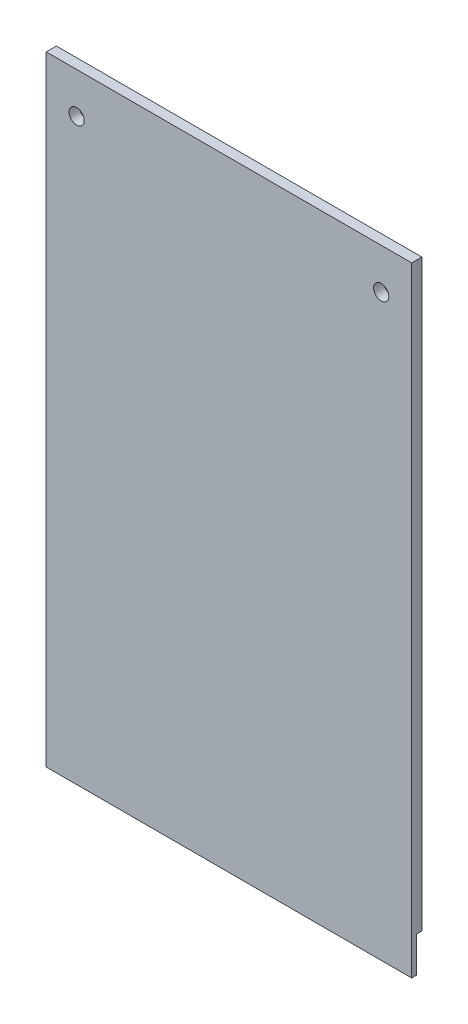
ISO-10303-21;
HEADER;
FILE_DESCRIPTION(('STEP AP214'),'2;1');
FILE_NAME('part.step','',(''),(''),'','','');
FILE_SCHEMA(('AUTOMOTIVE_DESIGN { 1 0 10303 214 1 1 1 1 }'));
ENDSEC;
DATA;
#1=APPLICATION_CONTEXT('core data for automotive mechanical design processes');
#2=APPLICATION_PROTOCOL_DEFINITION('international standard','automotive_design',2000,#1);
#3=PRODUCT_CONTEXT('',#1,'mechanical');
#4=PRODUCT('Part','Part','',(#3));
#5=PRODUCT_RELATED_PRODUCT_CATEGORY('part','',(#4));
#6=PRODUCT_DEFINITION_FORMATION('','',#4);
#7=PRODUCT_DEFINITION_CONTEXT('part definition',#1,'design');
#8=PRODUCT_DEFINITION('design','',#6,#7);
#9=PRODUCT_DEFINITION_SHAPE('','',#8);
#10=(LENGTH_UNIT() NAMED_UNIT(*) SI_UNIT(.MILLI.,.METRE.));
#11=(NAMED_UNIT(*) PLANE_ANGLE_UNIT() SI_UNIT($,.RADIAN.));
#12=(NAMED_UNIT(*) SI_UNIT($,.STERADIAN.) SOLID_ANGLE_UNIT());
#13=UNCERTAINTY_MEASURE_WITH_UNIT(LENGTH_MEASURE(1.E-05),#10,'distance_accuracy_value','');
#14=(GEOMETRIC_REPRESENTATION_CONTEXT(3) GLOBAL_UNCERTAINTY_ASSIGNED_CONTEXT((#13)) GLOBAL_UNIT_ASSIGNED_CONTEXT((#10,
#11,#12)) REPRESENTATION_CONTEXT('',''));
#15=CARTESIAN_POINT('',(0.,0.,0.));
#16=DIRECTION('',(0.,0.,1.));
#17=DIRECTION('',(1.,0.,0.));
#18=AXIS2_PLACEMENT_3D('',#15,#16,#17);
#19=CARTESIAN_POINT('',(36.,122.,2.));
#20=DIRECTION('',(-1.,0.,0.));
#21=DIRECTION('',(0.,-1.,0.));
#22=AXIS2_PLACEMENT_3D('',#19,#20,#21);
#23=PLANE('',#22);
#24=DIRECTION('',(0.,0.,1.));
#25=VECTOR('',#24,1.);
#26=CARTESIAN_POINT('',(36.,0.,0.));
#27=LINE('',#26,#25);
#28=CARTESIAN_POINT('',(36.,0.,1.));
#29=VERTEX_POINT('',#28);
#30=CARTESIAN_POINT('',(36.,0.,2.));
#31=VERTEX_POINT('',#30);
#32=EDGE_CURVE('E116',#29,#31,#27,.T.);
#33=ORIENTED_EDGE('',*,*,#32,.F.);
#34=DIRECTION('',(0.,-1.,0.));
#35=VECTOR('',#34,1.);
#36=CARTESIAN_POINT('',(36.,0.,1.));
#37=LINE('',#36,#35);
#38=CARTESIAN_POINT('',(36.,7.,1.));
#39=VERTEX_POINT('',#38);
#40=EDGE_CURVE('E53',#39,#29,#37,.T.);
#41=ORIENTED_EDGE('',*,*,#40,.F.);
#42=DIRECTION('',(0.,0.,1.));
#43=VECTOR('',#42,1.);
#44=CARTESIAN_POINT('',(36.,7.,1.));
#45=LINE('',#44,#43);
#46=CARTESIAN_POINT('',(36.,7.,0.));
#47=VERTEX_POINT('',#46);
#48=EDGE_CURVE('E131',#47,#39,#45,.T.);
#49=ORIENTED_EDGE('',*,*,#48,.F.);
#50=DIRECTION('',(0.,1.,0.));
#51=VECTOR('',#50,1.);
#52=CARTESIAN_POINT('',(36.,122.,0.));
#53=LINE('',#52,#51);
#54=CARTESIAN_POINT('',(36.,122.,0.));
#55=VERTEX_POINT('',#54);
#56=EDGE_CURVE('E83',#47,#55,#53,.T.);
#57=ORIENTED_EDGE('',*,*,#56,.T.);
#58=DIRECTION('',(0.,0.,-1.));
#59=VECTOR('',#58,1.);
#60=CARTESIAN_POINT('',(36.,122.,2.));
#61=LINE('',#60,#59);
#62=CARTESIAN_POINT('',(36.,122.,2.));
#63=VERTEX_POINT('',#62);
#64=EDGE_CURVE('E11',#63,#55,#61,.T.);
#65=ORIENTED_EDGE('',*,*,#64,.F.);
#66=DIRECTION('',(0.,1.,0.));
#67=VECTOR('',#66,1.);
#68=CARTESIAN_POINT('',(36.,122.,2.));
#69=LINE('',#68,#67);
#70=EDGE_CURVE('E96',#31,#63,#69,.T.);
#71=ORIENTED_EDGE('',*,*,#70,.F.);
#72=EDGE_LOOP('',(#33,#41,#49,#57,#65,#71));
#73=FACE_BOUND('',#72,.T.);
#74=ADVANCED_FACE('F39',(#73),#23,.F.);
#75=CARTESIAN_POINT('',(-36.,122.,2.));
#76=DIRECTION('',(0.,-1.,0.));
#77=DIRECTION('',(0.,0.,-1.));
#78=AXIS2_PLACEMENT_3D('',#75,#76,#77);
#79=PLANE('',#78);
#80=DIRECTION('',(-1.,0.,0.));
#81=VECTOR('',#80,1.);
#82=CARTESIAN_POINT('',(-36.,122.,0.));
#83=LINE('',#82,#81);
#84=CARTESIAN_POINT('',(-36.,122.,0.));
#85=VERTEX_POINT('',#84);
#86=EDGE_CURVE('E74',#55,#85,#83,.T.);
#87=ORIENTED_EDGE('',*,*,#86,.T.);
#88=DIRECTION('',(0.,0.,-1.));
#89=VECTOR('',#88,1.);
#90=CARTESIAN_POINT('',(-36.,122.,2.));
#91=LINE('',#90,#89);
#92=CARTESIAN_POINT('',(-36.,122.,2.));
#93=VERTEX_POINT('',#92);
#94=EDGE_CURVE('E46',#93,#85,#91,.T.);
#95=ORIENTED_EDGE('',*,*,#94,.F.);
#96=DIRECTION('',(-1.,0.,0.));
#97=VECTOR('',#96,1.);
#98=CARTESIAN_POINT('',(-36.,122.,2.));
#99=LINE('',#98,#97);
#100=EDGE_CURVE('E62',#63,#93,#99,.T.);
#101=ORIENTED_EDGE('',*,*,#100,.F.);
#102=ORIENTED_EDGE('',*,*,#64,.T.);
#103=EDGE_LOOP('',(#87,#95,#101,#102));
#104=FACE_BOUND('',#103,.T.);
#105=ADVANCED_FACE('F76',(#104),#79,.F.);
#106=CARTESIAN_POINT('',(-36.,122.,2.));
#107=DIRECTION('',(1.,0.,0.));
#108=DIRECTION('',(0.,1.,0.));
#109=AXIS2_PLACEMENT_3D('',#106,#107,#108);
#110=PLANE('',#109);
#111=DIRECTION('',(0.,0.,1.));
#112=VECTOR('',#111,1.);
#113=CARTESIAN_POINT('',(-36.,7.,1.));
#114=LINE('',#113,#112);
#115=CARTESIAN_POINT('',(-36.,7.,0.));
#116=VERTEX_POINT('',#115);
#117=CARTESIAN_POINT('',(-36.,7.,1.));
#118=VERTEX_POINT('',#117);
#119=EDGE_CURVE('E130',#116,#118,#114,.T.);
#120=ORIENTED_EDGE('',*,*,#119,.T.);
#121=DIRECTION('',(0.,-1.,0.));
#122=VECTOR('',#121,1.);
#123=CARTESIAN_POINT('',(-36.,0.,1.));
#124=LINE('',#123,#122);
#125=CARTESIAN_POINT('',(-36.,0.,1.));
#126=VERTEX_POINT('',#125);
#127=EDGE_CURVE('E126',#118,#126,#124,.T.);
#128=ORIENTED_EDGE('',*,*,#127,.T.);
#129=DIRECTION('',(0.,0.,1.));
#130=VECTOR('',#129,1.);
#131=CARTESIAN_POINT('',(-36.,0.,0.));
#132=LINE('',#131,#130);
#133=CARTESIAN_POINT('',(-36.,0.,2.));
#134=VERTEX_POINT('',#133);
#135=EDGE_CURVE('E113',#126,#134,#132,.T.);
#136=ORIENTED_EDGE('',*,*,#135,.T.);
#137=DIRECTION('',(0.,-1.,0.));
#138=VECTOR('',#137,1.);
#139=CARTESIAN_POINT('',(-36.,122.,2.));
#140=LINE('',#139,#138);
#141=EDGE_CURVE('E91',#93,#134,#140,.T.);
#142=ORIENTED_EDGE('',*,*,#141,.F.);
#143=ORIENTED_EDGE('',*,*,#94,.T.);
#144=DIRECTION('',(0.,-1.,0.));
#145=VECTOR('',#144,1.);
#146=CARTESIAN_POINT('',(-36.,122.,0.));
#147=LINE('',#146,#145);
#148=EDGE_CURVE('E82',#85,#116,#147,.T.);
#149=ORIENTED_EDGE('',*,*,#148,.T.);
#150=EDGE_LOOP('',(#120,#128,#136,#142,#143,#149));
#151=FACE_BOUND('',#150,.T.);
#152=ADVANCED_FACE('F88',(#151),#110,.F.);
#153=CARTESIAN_POINT('',(0.,0.,2.));
#154=DIRECTION('',(0.,0.,1.));
#155=DIRECTION('',(1.,0.,0.));
#156=AXIS2_PLACEMENT_3D('',#153,#154,#155);
#157=PLANE('',#156);
#158=DIRECTION('',(-1.,0.,0.));
#159=VECTOR('',#158,1.);
#160=CARTESIAN_POINT('',(-36.,0.,2.));
#161=LINE('',#160,#159);
#162=EDGE_CURVE('E119',#31,#134,#161,.T.);
#163=ORIENTED_EDGE('',*,*,#162,.F.);
#164=ORIENTED_EDGE('',*,*,#70,.T.);
#165=ORIENTED_EDGE('',*,*,#100,.T.);
#166=ORIENTED_EDGE('',*,*,#141,.T.);
#167=EDGE_LOOP('',(#163,#164,#165,#166));
#168=FACE_BOUND('',#167,.T.);
#169=CARTESIAN_POINT('',(-30.,114.,2.));
#170=DIRECTION('',(0.,0.,1.));
#171=DIRECTION('',(1.,0.,0.));
#172=AXIS2_PLACEMENT_3D('',#169,#170,#171);
#173=CIRCLE('',#172,1.5);
#174=CARTESIAN_POINT('',(-28.5,114.,2.));
#175=VERTEX_POINT('',#174);
#176=EDGE_CURVE('E107',#175,#175,#173,.T.);
#177=ORIENTED_EDGE('',*,*,#176,.F.);
#178=EDGE_LOOP('',(#177));
#179=FACE_BOUND('',#178,.T.);
#180=CARTESIAN_POINT('',(30.,114.,2.));
#181=DIRECTION('',(0.,0.,1.));
#182=DIRECTION('',(1.,0.,0.));
#183=AXIS2_PLACEMENT_3D('',#180,#181,#182);
#184=CIRCLE('',#183,1.5);
#185=CARTESIAN_POINT('',(31.5,114.,2.));
#186=VERTEX_POINT('',#185);
#187=EDGE_CURVE('E104',#186,#186,#184,.T.);
#188=ORIENTED_EDGE('',*,*,#187,.F.);
#189=EDGE_LOOP('',(#188));
#190=FACE_BOUND('',#189,.T.);
#191=ADVANCED_FACE('F159',(#168,#179,#190),#157,.T.);
#192=CARTESIAN_POINT('',(0.,0.,0.));
#193=DIRECTION('',(0.,0.,1.));
#194=DIRECTION('',(1.,0.,0.));
#195=AXIS2_PLACEMENT_3D('',#192,#193,#194);
#196=PLANE('',#195);
#197=CARTESIAN_POINT('',(-30.,114.,0.));
#198=DIRECTION('',(0.,0.,1.));
#199=DIRECTION('',(1.,0.,0.));
#200=AXIS2_PLACEMENT_3D('',#197,#198,#199);
#201=CIRCLE('',#200,1.5);
#202=CARTESIAN_POINT('',(-28.5,114.,0.));
#203=VERTEX_POINT('',#202);
#204=EDGE_CURVE('E110',#203,#203,#201,.T.);
#205=ORIENTED_EDGE('',*,*,#204,.T.);
#206=EDGE_LOOP('',(#205));
#207=FACE_BOUND('',#206,.T.);
#208=CARTESIAN_POINT('',(30.,114.,0.));
#209=DIRECTION('',(0.,0.,1.));
#210=DIRECTION('',(1.,0.,0.));
#211=AXIS2_PLACEMENT_3D('',#208,#209,#210);
#212=CIRCLE('',#211,1.5);
#213=CARTESIAN_POINT('',(31.5,114.,0.));
#214=VERTEX_POINT('',#213);
#215=EDGE_CURVE('E101',#214,#214,#212,.T.);
#216=ORIENTED_EDGE('',*,*,#215,.T.);
#217=EDGE_LOOP('',(#216));
#218=FACE_BOUND('',#217,.T.);
#219=ORIENTED_EDGE('',*,*,#56,.F.);
#220=DIRECTION('',(1.,0.,0.));
#221=VECTOR('',#220,1.);
#222=CARTESIAN_POINT('',(-36.,7.,0.));
#223=LINE('',#222,#221);
#224=EDGE_CURVE('E95',#116,#47,#223,.T.);
#225=ORIENTED_EDGE('',*,*,#224,.F.);
#226=ORIENTED_EDGE('',*,*,#148,.F.);
#227=ORIENTED_EDGE('',*,*,#86,.F.);
#228=EDGE_LOOP('',(#219,#225,#226,#227));
#229=FACE_BOUND('',#228,.T.);
#230=ADVANCED_FACE('F93',(#207,#218,#229),#196,.F.);
#231=CARTESIAN_POINT('',(30.,114.,0.));
#232=DIRECTION('',(0.,0.,1.));
#233=DIRECTION('',(1.,0.,0.));
#234=AXIS2_PLACEMENT_3D('',#231,#232,#233);
#235=CYLINDRICAL_SURFACE('',#234,1.5);
#236=ORIENTED_EDGE('',*,*,#215,.F.);
#237=EDGE_LOOP('',(#236));
#238=FACE_BOUND('',#237,.T.);
#239=ORIENTED_EDGE('',*,*,#187,.T.);
#240=EDGE_LOOP('',(#239));
#241=FACE_BOUND('',#240,.T.);
#242=ADVANCED_FACE('F167',(#238,#241),#235,.F.);
#243=CARTESIAN_POINT('',(-30.,114.,0.));
#244=DIRECTION('',(0.,0.,1.));
#245=DIRECTION('',(1.,0.,0.));
#246=AXIS2_PLACEMENT_3D('',#243,#244,#245);
#247=CYLINDRICAL_SURFACE('',#246,1.5);
#248=ORIENTED_EDGE('',*,*,#204,.F.);
#249=EDGE_LOOP('',(#248));
#250=FACE_BOUND('',#249,.T.);
#251=ORIENTED_EDGE('',*,*,#176,.T.);
#252=EDGE_LOOP('',(#251));
#253=FACE_BOUND('',#252,.T.);
#254=ADVANCED_FACE('F169',(#250,#253),#247,.F.);
#255=CARTESIAN_POINT('',(-36.,0.,0.));
#256=DIRECTION('',(0.,1.,0.));
#257=DIRECTION('',(0.,0.,1.));
#258=AXIS2_PLACEMENT_3D('',#255,#256,#257);
#259=PLANE('',#258);
#260=ORIENTED_EDGE('',*,*,#135,.F.);
#261=DIRECTION('',(1.,0.,0.));
#262=VECTOR('',#261,1.);
#263=CARTESIAN_POINT('',(-36.,0.,1.));
#264=LINE('',#263,#262);
#265=EDGE_CURVE('E123',#126,#29,#264,.T.);
#266=ORIENTED_EDGE('',*,*,#265,.T.);
#267=ORIENTED_EDGE('',*,*,#32,.T.);
#268=ORIENTED_EDGE('',*,*,#162,.T.);
#269=EDGE_LOOP('',(#260,#266,#267,#268));
#270=FACE_BOUND('',#269,.T.);
#271=ADVANCED_FACE('F156',(#270),#259,.F.);
#272=CARTESIAN_POINT('',(-36.,0.,1.));
#273=DIRECTION('',(0.,0.,1.));
#274=DIRECTION('',(1.,0.,0.));
#275=AXIS2_PLACEMENT_3D('',#272,#273,#274);
#276=PLANE('',#275);
#277=ORIENTED_EDGE('',*,*,#40,.T.);
#278=ORIENTED_EDGE('',*,*,#265,.F.);
#279=ORIENTED_EDGE('',*,*,#127,.F.);
#280=DIRECTION('',(1.,0.,0.));
#281=VECTOR('',#280,1.);
#282=CARTESIAN_POINT('',(-36.,7.,1.));
#283=LINE('',#282,#281);
#284=EDGE_CURVE('E125',#118,#39,#283,.T.);
#285=ORIENTED_EDGE('',*,*,#284,.T.);
#286=EDGE_LOOP('',(#277,#278,#279,#285));
#287=FACE_BOUND('',#286,.T.);
#288=ADVANCED_FACE('F212',(#287),#276,.F.);
#289=CARTESIAN_POINT('',(-36.,7.,1.));
#290=DIRECTION('',(0.,1.,0.));
#291=DIRECTION('',(-1.,0.,0.));
#292=AXIS2_PLACEMENT_3D('',#289,#290,#291);
#293=PLANE('',#292);
#294=ORIENTED_EDGE('',*,*,#48,.T.);
#295=ORIENTED_EDGE('',*,*,#284,.F.);
#296=ORIENTED_EDGE('',*,*,#119,.F.);
#297=ORIENTED_EDGE('',*,*,#224,.T.);
#298=EDGE_LOOP('',(#294,#295,#296,#297));
#299=FACE_BOUND('',#298,.T.);
#300=ADVANCED_FACE('F144',(#299),#293,.F.);
#301=CLOSED_SHELL('',(#74,#105,#152,#191,#230,#242,#254,#271,#288,#300));
#302=MANIFOLD_SOLID_BREP('B2',#301);
#303=ADVANCED_BREP_SHAPE_REPRESENTATION('',(#18,#302),#14);
#304=SHAPE_DEFINITION_REPRESENTATION(#9,#303);
ENDSEC;
END-ISO-10303-21;
